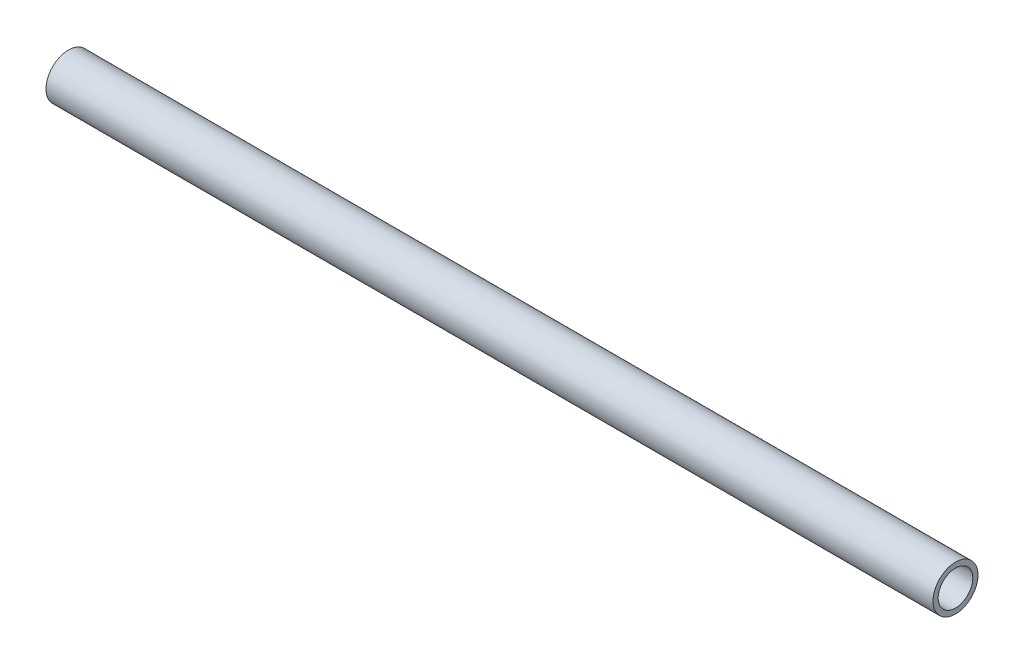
ISO-10303-21;
HEADER;
FILE_DESCRIPTION(('STEP AP214'),'2;1');
FILE_NAME('part.step','',(''),(''),'','','');
FILE_SCHEMA(('AUTOMOTIVE_DESIGN { 1 0 10303 214 1 1 1 1 }'));
ENDSEC;
DATA;
#1=APPLICATION_CONTEXT('core data for automotive mechanical design processes');
#2=APPLICATION_PROTOCOL_DEFINITION('international standard','automotive_design',2000,#1);
#3=PRODUCT_CONTEXT('',#1,'mechanical');
#4=PRODUCT('Part','Part','',(#3));
#5=PRODUCT_RELATED_PRODUCT_CATEGORY('part','',(#4));
#6=PRODUCT_DEFINITION_FORMATION('','',#4);
#7=PRODUCT_DEFINITION_CONTEXT('part definition',#1,'design');
#8=PRODUCT_DEFINITION('design','',#6,#7);
#9=PRODUCT_DEFINITION_SHAPE('','',#8);
#10=(LENGTH_UNIT() NAMED_UNIT(*) SI_UNIT(.MILLI.,.METRE.));
#11=(NAMED_UNIT(*) PLANE_ANGLE_UNIT() SI_UNIT($,.RADIAN.));
#12=(NAMED_UNIT(*) SI_UNIT($,.STERADIAN.) SOLID_ANGLE_UNIT());
#13=UNCERTAINTY_MEASURE_WITH_UNIT(LENGTH_MEASURE(1.E-05),#10,'distance_accuracy_value','');
#14=(GEOMETRIC_REPRESENTATION_CONTEXT(3) GLOBAL_UNCERTAINTY_ASSIGNED_CONTEXT((#13)) GLOBAL_UNIT_ASSIGNED_CONTEXT((#10,
#11,#12)) REPRESENTATION_CONTEXT('',''));
#15=CARTESIAN_POINT('',(0.,0.,0.));
#16=DIRECTION('',(0.,0.,1.));
#17=DIRECTION('',(1.,0.,0.));
#18=AXIS2_PLACEMENT_3D('',#15,#16,#17);
#19=CARTESIAN_POINT('',(650.875,0.,0.));
#20=DIRECTION('',(-1.,0.,0.));
#21=DIRECTION('',(0.,0.,1.));
#22=AXIS2_PLACEMENT_3D('',#19,#20,#21);
#23=CYLINDRICAL_SURFACE('',#22,12.7);
#24=CARTESIAN_POINT('',(650.875,0.,0.));
#25=DIRECTION('',(1.,0.,0.));
#26=DIRECTION('',(0.,0.,-1.));
#27=AXIS2_PLACEMENT_3D('',#24,#25,#26);
#28=CIRCLE('',#27,12.7);
#29=CARTESIAN_POINT('',(650.875,0.,-12.7));
#30=VERTEX_POINT('',#29);
#31=EDGE_CURVE('E53',#30,#30,#28,.T.);
#32=ORIENTED_EDGE('',*,*,#31,.T.);
#33=EDGE_LOOP('',(#32));
#34=FACE_BOUND('',#33,.T.);
#35=CARTESIAN_POINT('',(0.,0.,0.));
#36=DIRECTION('',(1.,0.,0.));
#37=DIRECTION('',(0.,0.,-1.));
#38=AXIS2_PLACEMENT_3D('',#35,#36,#37);
#39=CIRCLE('',#38,12.7);
#40=CARTESIAN_POINT('',(0.,0.,-12.7));
#41=VERTEX_POINT('',#40);
#42=EDGE_CURVE('E60',#41,#41,#39,.T.);
#43=ORIENTED_EDGE('',*,*,#42,.F.);
#44=EDGE_LOOP('',(#43));
#45=FACE_BOUND('',#44,.T.);
#46=ADVANCED_FACE('F45',(#34,#45),#23,.F.);
#47=CARTESIAN_POINT('',(650.875,0.,0.));
#48=DIRECTION('',(-1.,0.,0.));
#49=DIRECTION('',(0.,0.,1.));
#50=AXIS2_PLACEMENT_3D('',#47,#48,#49);
#51=CYLINDRICAL_SURFACE('',#50,16.51);
#52=CARTESIAN_POINT('',(650.875,0.,0.));
#53=DIRECTION('',(1.,0.,0.));
#54=DIRECTION('',(0.,0.,-1.));
#55=AXIS2_PLACEMENT_3D('',#52,#53,#54);
#56=CIRCLE('',#55,16.51);
#57=CARTESIAN_POINT('',(650.875,0.,-16.51));
#58=VERTEX_POINT('',#57);
#59=EDGE_CURVE('E10',#58,#58,#56,.T.);
#60=ORIENTED_EDGE('',*,*,#59,.F.);
#61=EDGE_LOOP('',(#60));
#62=FACE_BOUND('',#61,.T.);
#63=CARTESIAN_POINT('',(0.,0.,0.));
#64=DIRECTION('',(1.,0.,0.));
#65=DIRECTION('',(0.,0.,-1.));
#66=AXIS2_PLACEMENT_3D('',#63,#64,#65);
#67=CIRCLE('',#66,16.51);
#68=CARTESIAN_POINT('',(0.,0.,-16.51));
#69=VERTEX_POINT('',#68);
#70=EDGE_CURVE('E48',#69,#69,#67,.T.);
#71=ORIENTED_EDGE('',*,*,#70,.T.);
#72=EDGE_LOOP('',(#71));
#73=FACE_BOUND('',#72,.T.);
#74=ADVANCED_FACE('F69',(#62,#73),#51,.T.);
#75=CARTESIAN_POINT('',(650.875,0.,0.));
#76=DIRECTION('',(1.,0.,0.));
#77=DIRECTION('',(0.,0.,-1.));
#78=AXIS2_PLACEMENT_3D('',#75,#76,#77);
#79=PLANE('',#78);
#80=ORIENTED_EDGE('',*,*,#31,.F.);
#81=EDGE_LOOP('',(#80));
#82=FACE_BOUND('',#81,.T.);
#83=ORIENTED_EDGE('',*,*,#59,.T.);
#84=EDGE_LOOP('',(#83));
#85=FACE_BOUND('',#84,.T.);
#86=ADVANCED_FACE('F73',(#82,#85),#79,.T.);
#87=CARTESIAN_POINT('',(0.,0.,0.));
#88=DIRECTION('',(1.,0.,0.));
#89=DIRECTION('',(0.,0.,-1.));
#90=AXIS2_PLACEMENT_3D('',#87,#88,#89);
#91=PLANE('',#90);
#92=ORIENTED_EDGE('',*,*,#42,.T.);
#93=EDGE_LOOP('',(#92));
#94=FACE_BOUND('',#93,.T.);
#95=ORIENTED_EDGE('',*,*,#70,.F.);
#96=EDGE_LOOP('',(#95));
#97=FACE_BOUND('',#96,.T.);
#98=ADVANCED_FACE('F71',(#94,#97),#91,.F.);
#99=CLOSED_SHELL('',(#46,#74,#86,#98));
#100=MANIFOLD_SOLID_BREP('B2',#99);
#101=ADVANCED_BREP_SHAPE_REPRESENTATION('',(#18,#100),#14);
#102=SHAPE_DEFINITION_REPRESENTATION(#9,#101);
ENDSEC;
END-ISO-10303-21;
